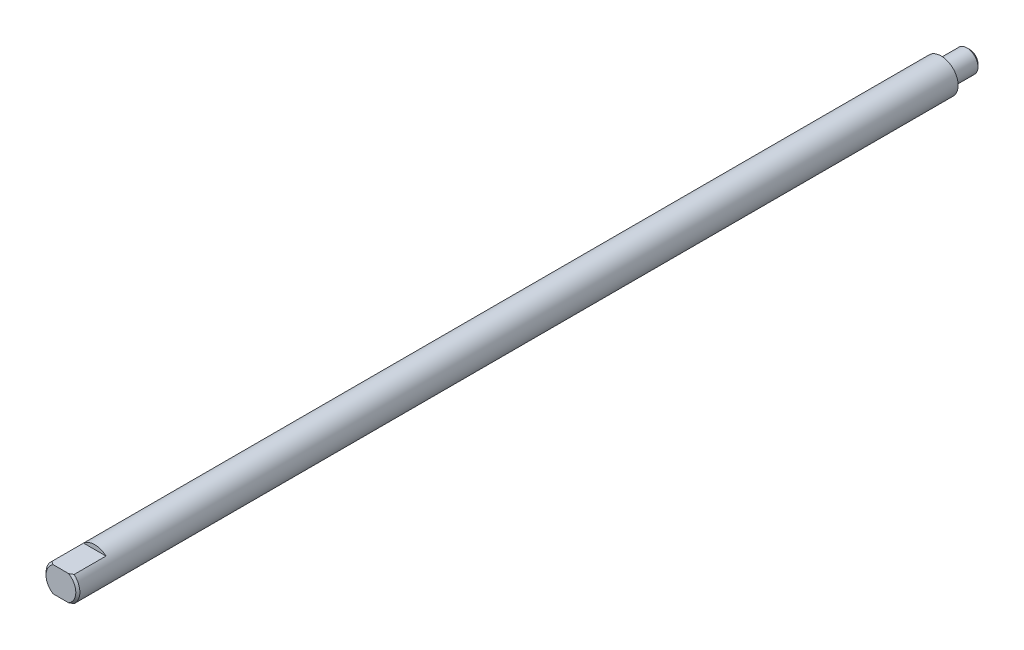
ISO-10303-21;
HEADER;
FILE_DESCRIPTION(('STEP AP214'),'2;1');
FILE_NAME('part.step','',(''),(''),'','','');
FILE_SCHEMA(('AUTOMOTIVE_DESIGN { 1 0 10303 214 1 1 1 1 }'));
ENDSEC;
DATA;
#1=APPLICATION_CONTEXT('core data for automotive mechanical design processes');
#2=APPLICATION_PROTOCOL_DEFINITION('international standard','automotive_design',2000,#1);
#3=PRODUCT_CONTEXT('',#1,'mechanical');
#4=PRODUCT('Part','Part','',(#3));
#5=PRODUCT_RELATED_PRODUCT_CATEGORY('part','',(#4));
#6=PRODUCT_DEFINITION_FORMATION('','',#4);
#7=PRODUCT_DEFINITION_CONTEXT('part definition',#1,'design');
#8=PRODUCT_DEFINITION('design','',#6,#7);
#9=PRODUCT_DEFINITION_SHAPE('','',#8);
#10=(LENGTH_UNIT() NAMED_UNIT(*) SI_UNIT(.MILLI.,.METRE.));
#11=(NAMED_UNIT(*) PLANE_ANGLE_UNIT() SI_UNIT($,.RADIAN.));
#12=(NAMED_UNIT(*) SI_UNIT($,.STERADIAN.) SOLID_ANGLE_UNIT());
#13=UNCERTAINTY_MEASURE_WITH_UNIT(LENGTH_MEASURE(1.E-05),#10,'distance_accuracy_value','');
#14=(GEOMETRIC_REPRESENTATION_CONTEXT(3) GLOBAL_UNCERTAINTY_ASSIGNED_CONTEXT((#13)) GLOBAL_UNIT_ASSIGNED_CONTEXT((#10,
#11,#12)) REPRESENTATION_CONTEXT('',''));
#15=CARTESIAN_POINT('',(0.,0.,0.));
#16=DIRECTION('',(0.,0.,1.));
#17=DIRECTION('',(1.,0.,0.));
#18=AXIS2_PLACEMENT_3D('',#15,#16,#17);
#19=CARTESIAN_POINT('',(0.,0.,3.684));
#20=DIRECTION('',(0.,0.,-1.));
#21=DIRECTION('',(0.,1.,0.));
#22=AXIS2_PLACEMENT_3D('',#19,#20,#21);
#23=CONICAL_SURFACE('',#22,3.175,0.791934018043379);
#24=CARTESIAN_POINT('',(0.,0.,3.684));
#25=DIRECTION('',(0.,0.,1.));
#26=DIRECTION('',(0.,-1.,0.));
#27=AXIS2_PLACEMENT_3D('',#24,#25,#26);
#28=CIRCLE('',#27,3.175);
#29=CARTESIAN_POINT('',(-2.10713075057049,2.37500000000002,3.684));
#30=VERTEX_POINT('',#29);
#31=CARTESIAN_POINT('',(-2.10713075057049,-2.37500000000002,3.684));
#32=VERTEX_POINT('',#31);
#33=EDGE_CURVE('E105',#30,#32,#28,.T.);
#34=ORIENTED_EDGE('',*,*,#33,.T.);
#35=CARTESIAN_POINT('',(-6.62966945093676,-2.37500000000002,-0.13301595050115));
#36=CARTESIAN_POINT('',(-6.41872085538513,-2.37500000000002,0.0629362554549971));
#37=CARTESIAN_POINT('',(-6.20729327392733,-2.37500000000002,0.258380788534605));
#38=CARTESIAN_POINT('',(-5.78286017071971,-2.37500000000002,0.647887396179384));
#39=CARTESIAN_POINT('',(-5.56985352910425,-2.37500000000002,0.841948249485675));
#40=CARTESIAN_POINT('',(-5.13574053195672,-2.37500000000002,1.23363349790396));
#41=CARTESIAN_POINT('',(-4.9145790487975,-2.37500000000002,1.43119690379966));
#42=CARTESIAN_POINT('',(-4.46963283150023,-2.37500000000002,1.82304516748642));
#43=CARTESIAN_POINT('',(-4.24585006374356,-2.37500000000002,2.01733224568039));
#44=CARTESIAN_POINT('',(-3.90719638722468,-2.37500000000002,2.30510248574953));
#45=CARTESIAN_POINT('',(-3.79385459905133,-2.37500000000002,2.40038380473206));
#46=CARTESIAN_POINT('',(-3.56590809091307,-2.37500000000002,2.58942155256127));
#47=CARTESIAN_POINT('',(-3.45130340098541,-2.37500000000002,2.6831780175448));
#48=CARTESIAN_POINT('',(-3.22025369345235,-2.37500000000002,2.86895465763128));
#49=CARTESIAN_POINT('',(-3.10380502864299,-2.37500000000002,2.96097030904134));
#50=CARTESIAN_POINT('',(-2.86892224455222,-2.37500000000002,3.1424196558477));
#51=CARTESIAN_POINT('',(-2.75048831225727,-2.37500000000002,3.23185359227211));
#52=CARTESIAN_POINT('',(-2.51255729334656,-2.37500000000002,3.40617108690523));
#53=CARTESIAN_POINT('',(-2.39309165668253,-2.37500000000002,3.49109735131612));
#54=CARTESIAN_POINT('',(-2.15090508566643,-2.37500000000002,3.65634247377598));
#55=CARTESIAN_POINT('',(-2.0281826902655,-2.37500000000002,3.73665921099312));
#56=CARTESIAN_POINT('',(-1.77912466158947,-2.37500000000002,3.89039659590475));
#57=CARTESIAN_POINT('',(-1.65280524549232,-2.37500000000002,3.96384327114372));
#58=CARTESIAN_POINT('',(-1.3951251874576,-2.37500000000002,4.10119391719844));
#59=CARTESIAN_POINT('',(-1.26377071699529,-2.37500000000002,4.16510912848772));
#60=CARTESIAN_POINT('',(-1.05701971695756,-2.37500000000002,4.25273595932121));
#61=CARTESIAN_POINT('',(-0.983728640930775,-2.37500000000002,4.28140199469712));
#62=CARTESIAN_POINT('',(-0.83535687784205,-2.37500000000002,4.33377721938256));
#63=CARTESIAN_POINT('',(-0.760275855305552,-2.37500000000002,4.35748547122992));
#64=CARTESIAN_POINT('',(-0.608898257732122,-2.37500000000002,4.39885359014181));
#65=CARTESIAN_POINT('',(-0.53261091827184,-2.37500000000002,4.41654679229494));
#66=CARTESIAN_POINT('',(-0.378780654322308,-2.37500000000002,4.44515427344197));
#67=CARTESIAN_POINT('',(-0.301238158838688,-2.37500000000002,4.45607082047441));
#68=CARTESIAN_POINT('',(-0.144559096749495,-2.37500000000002,4.47054748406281));
#69=CARTESIAN_POINT('',(-0.0654144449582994,-2.37500000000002,4.47402190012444));
#70=CARTESIAN_POINT('',(0.0928249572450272,-2.37500000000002,4.47312081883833));
#71=CARTESIAN_POINT('',(0.17191970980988,-2.37500000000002,4.46874568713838));
#72=CARTESIAN_POINT('',(0.329626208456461,-2.37500000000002,4.45241265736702));
#73=CARTESIAN_POINT('',(0.408234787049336,-2.37500000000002,4.44042470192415));
#74=CARTESIAN_POINT('',(0.564086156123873,-2.37500000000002,4.40957980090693));
#75=CARTESIAN_POINT('',(0.641328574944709,-2.37500000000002,4.39072101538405));
#76=CARTESIAN_POINT('',(0.827865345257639,-2.37500000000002,4.33746225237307));
#77=CARTESIAN_POINT('',(0.936246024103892,-2.37500000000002,4.2998770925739));
#78=CARTESIAN_POINT('',(1.14927492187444,-2.37500000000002,4.21535984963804));
#79=CARTESIAN_POINT('',(1.25392057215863,-2.37500000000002,4.16842147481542));
#80=CARTESIAN_POINT('',(1.4608710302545,-2.37500000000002,4.06709514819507));
#81=CARTESIAN_POINT('',(1.56313950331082,-2.37500000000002,4.01263383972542));
#82=CARTESIAN_POINT('',(1.71427099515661,-2.37500000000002,3.9270384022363));
#83=CARTESIAN_POINT('',(1.76426245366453,-2.37500000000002,3.89786057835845));
#84=CARTESIAN_POINT('',(1.86356372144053,-2.37500000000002,3.83837009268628));
#85=CARTESIAN_POINT('',(1.91287355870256,-2.37500000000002,3.80805747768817));
#86=CARTESIAN_POINT('',(2.07522042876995,-2.37500000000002,3.70601224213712));
#87=CARTESIAN_POINT('',(2.18692206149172,-2.37500000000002,3.63215349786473));
#88=CARTESIAN_POINT('',(2.40772318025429,-2.37500000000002,3.48062951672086));
#89=CARTESIAN_POINT('',(2.51682205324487,-2.37500000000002,3.40296339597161));
#90=CARTESIAN_POINT('',(2.73301390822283,-2.37500000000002,3.24473477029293));
#91=CARTESIAN_POINT('',(2.84010537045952,-2.37500000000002,3.16417019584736));
#92=CARTESIAN_POINT('',(3.05261723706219,-2.37500000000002,3.00086187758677));
#93=CARTESIAN_POINT('',(3.15803753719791,-2.37500000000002,2.9181179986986));
#94=CARTESIAN_POINT('',(3.47300086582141,-2.37500000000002,2.66679989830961));
#95=CARTESIAN_POINT('',(3.68051445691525,-2.37500000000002,2.49568568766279));
#96=CARTESIAN_POINT('',(4.09182405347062,-2.37500000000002,2.14926116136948));
#97=CARTESIAN_POINT('',(4.2956216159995,-2.37500000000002,1.97395267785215));
#98=CARTESIAN_POINT('',(4.67931232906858,-2.37500000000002,1.63905531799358));
#99=CARTESIAN_POINT('',(4.85946034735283,-2.37500000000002,1.47975783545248));
#100=CARTESIAN_POINT('',(5.21824582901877,-2.37500000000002,1.15942835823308));
#101=CARTESIAN_POINT('',(5.39688309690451,-2.37500000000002,0.998396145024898));
#102=CARTESIAN_POINT('',(5.75173692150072,-2.37500000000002,0.676174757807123));
#103=CARTESIAN_POINT('',(5.92796166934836,-2.37500000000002,0.514994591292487));
#104=CARTESIAN_POINT('',(6.27946145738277,-2.37500000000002,0.191659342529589));
#105=CARTESIAN_POINT('',(6.45473664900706,-2.37500000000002,0.0295044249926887));
#106=CARTESIAN_POINT('',(6.62966945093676,-2.37500000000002,-0.133015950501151));
#107=B_SPLINE_CURVE_WITH_KNOTS('',3,(#35,#36,#37,#38,#39,#40,#41,#42,#43,#44,#45,#46,#47,#48,
#49,#50,#51,#52,#53,#54,#55,#56,#57,#58,#59,#60,#61,#62,#63,#64,#65,#66,#67,#68,#69,#70,#71,#72,
#73,#74,#75,#76,#77,#78,#79,#80,#81,#82,#83,#84,#85,#86,#87,#88,#89,#90,#91,#92,#93,#94,#95,#96,
#97,#98,#99,#100,#101,#102,#103,#104,#105,#106),.UNSPECIFIED.,.F.,.F.,(4,2,2,2,2,2,2,2,2,2,2,2,
2,2,2,2,2,2,2,2,2,2,2,2,2,2,2,2,2,2,2,2,2,2,2,4),(0.,0.863760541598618,1.72820709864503,
2.61784876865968,3.50686109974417,3.95106286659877,4.39525409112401,4.84047397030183,
5.28565214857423,5.72530383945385,6.16515621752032,6.60326828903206,7.040859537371,
7.27681206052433,7.51280915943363,7.74747620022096,7.98206465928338,8.219340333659,
8.45660495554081,8.69481223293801,8.93308334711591,9.27660606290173,9.62036064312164,
9.96774119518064,10.1413805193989,10.3150126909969,10.7166254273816,11.118331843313,
11.5203310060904,11.9223551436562,12.7291420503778,13.535582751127,14.2569976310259,
14.9785044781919,15.6949553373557,16.4112883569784),.UNSPECIFIED.);
#108=CARTESIAN_POINT('',(-1.46406113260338,-2.37500000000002,4.064));
#109=VERTEX_POINT('',#108);
#110=EDGE_CURVE('E128',#32,#109,#107,.T.);
#111=ORIENTED_EDGE('',*,*,#110,.T.);
#112=CARTESIAN_POINT('',(0.,0.,4.064));
#113=DIRECTION('',(0.,0.,1.));
#114=DIRECTION('',(0.,-1.,0.));
#115=AXIS2_PLACEMENT_3D('',#112,#113,#114);
#116=CIRCLE('',#115,2.79);
#117=CARTESIAN_POINT('',(-1.46406113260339,2.37500000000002,4.064));
#118=VERTEX_POINT('',#117);
#119=EDGE_CURVE('E115',#118,#109,#116,.T.);
#120=ORIENTED_EDGE('',*,*,#119,.F.);
#121=CARTESIAN_POINT('',(6.62966945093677,2.37500000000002,-0.133015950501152));
#122=CARTESIAN_POINT('',(6.41872085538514,2.37500000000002,0.0629362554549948));
#123=CARTESIAN_POINT('',(6.20729327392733,2.37500000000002,0.258380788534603));
#124=CARTESIAN_POINT('',(5.78286017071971,2.37500000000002,0.647887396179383));
#125=CARTESIAN_POINT('',(5.56985352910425,2.37500000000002,0.841948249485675));
#126=CARTESIAN_POINT('',(5.13574053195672,2.37500000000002,1.23363349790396));
#127=CARTESIAN_POINT('',(4.9145790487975,2.37500000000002,1.43119690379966));
#128=CARTESIAN_POINT('',(4.46963283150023,2.37500000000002,1.82304516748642));
#129=CARTESIAN_POINT('',(4.24585006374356,2.37500000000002,2.01733224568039));
#130=CARTESIAN_POINT('',(3.90719638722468,2.37500000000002,2.30510248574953));
#131=CARTESIAN_POINT('',(3.79385459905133,2.37500000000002,2.40038380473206));
#132=CARTESIAN_POINT('',(3.56590809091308,2.37500000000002,2.58942155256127));
#133=CARTESIAN_POINT('',(3.45130340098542,2.37500000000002,2.6831780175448));
#134=CARTESIAN_POINT('',(3.22025369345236,2.37500000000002,2.86895465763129));
#135=CARTESIAN_POINT('',(3.10380502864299,2.37500000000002,2.96097030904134));
#136=CARTESIAN_POINT('',(2.86892224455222,2.37500000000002,3.14241965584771));
#137=CARTESIAN_POINT('',(2.75048831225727,2.37500000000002,3.23185359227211));
#138=CARTESIAN_POINT('',(2.51255729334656,2.37500000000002,3.40617108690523));
#139=CARTESIAN_POINT('',(2.39309165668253,2.37500000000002,3.49109735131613));
#140=CARTESIAN_POINT('',(2.15090508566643,2.37500000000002,3.65634247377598));
#141=CARTESIAN_POINT('',(2.0281826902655,2.37500000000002,3.73665921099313));
#142=CARTESIAN_POINT('',(1.77912466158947,2.37500000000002,3.89039659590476));
#143=CARTESIAN_POINT('',(1.65280524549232,2.37500000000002,3.96384327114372));
#144=CARTESIAN_POINT('',(1.39512518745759,2.37500000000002,4.10119391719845));
#145=CARTESIAN_POINT('',(1.26377071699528,2.37500000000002,4.16510912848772));
#146=CARTESIAN_POINT('',(1.05701971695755,2.37500000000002,4.25273595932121));
#147=CARTESIAN_POINT('',(0.983728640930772,2.37500000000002,4.28140199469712));
#148=CARTESIAN_POINT('',(0.835356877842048,2.37500000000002,4.33377721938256));
#149=CARTESIAN_POINT('',(0.76027585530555,2.37500000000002,4.35748547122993));
#150=CARTESIAN_POINT('',(0.608898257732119,2.37500000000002,4.39885359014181));
#151=CARTESIAN_POINT('',(0.532610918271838,2.37500000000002,4.41654679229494));
#152=CARTESIAN_POINT('',(0.378780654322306,2.37500000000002,4.44515427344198));
#153=CARTESIAN_POINT('',(0.301238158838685,2.37500000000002,4.45607082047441));
#154=CARTESIAN_POINT('',(0.144559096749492,2.37500000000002,4.47054748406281));
#155=CARTESIAN_POINT('',(0.0654144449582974,2.37500000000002,4.47402190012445));
#156=CARTESIAN_POINT('',(-0.0928249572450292,2.37500000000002,4.47312081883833));
#157=CARTESIAN_POINT('',(-0.171919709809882,2.37500000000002,4.46874568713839));
#158=CARTESIAN_POINT('',(-0.329626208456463,2.37500000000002,4.45241265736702));
#159=CARTESIAN_POINT('',(-0.408234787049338,2.37500000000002,4.44042470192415));
#160=CARTESIAN_POINT('',(-0.564086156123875,2.37500000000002,4.40957980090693));
#161=CARTESIAN_POINT('',(-0.641328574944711,2.37500000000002,4.39072101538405));
#162=CARTESIAN_POINT('',(-0.827865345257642,2.37500000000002,4.33746225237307));
#163=CARTESIAN_POINT('',(-0.936246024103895,2.37500000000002,4.29987709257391));
#164=CARTESIAN_POINT('',(-1.14927492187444,2.37500000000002,4.21535984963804));
#165=CARTESIAN_POINT('',(-1.25392057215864,2.37500000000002,4.16842147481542));
#166=CARTESIAN_POINT('',(-1.46087103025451,2.37500000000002,4.06709514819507));
#167=CARTESIAN_POINT('',(-1.56313950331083,2.37500000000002,4.01263383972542));
#168=CARTESIAN_POINT('',(-1.71427099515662,2.37500000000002,3.9270384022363));
#169=CARTESIAN_POINT('',(-1.76426245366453,2.37500000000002,3.89786057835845));
#170=CARTESIAN_POINT('',(-1.86356372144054,2.37500000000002,3.83837009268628));
#171=CARTESIAN_POINT('',(-1.91287355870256,2.37500000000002,3.80805747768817));
#172=CARTESIAN_POINT('',(-2.07522042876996,2.37500000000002,3.70601224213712));
#173=CARTESIAN_POINT('',(-2.18692206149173,2.37500000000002,3.63215349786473));
#174=CARTESIAN_POINT('',(-2.40772318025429,2.37500000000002,3.48062951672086));
#175=CARTESIAN_POINT('',(-2.51682205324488,2.37500000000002,3.40296339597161));
#176=CARTESIAN_POINT('',(-2.73301390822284,2.37500000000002,3.24473477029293));
#177=CARTESIAN_POINT('',(-2.84010537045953,2.37500000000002,3.16417019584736));
#178=CARTESIAN_POINT('',(-3.0526172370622,2.37500000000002,3.00086187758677));
#179=CARTESIAN_POINT('',(-3.15803753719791,2.37500000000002,2.9181179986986));
#180=CARTESIAN_POINT('',(-3.47300086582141,2.37500000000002,2.6667998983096));
#181=CARTESIAN_POINT('',(-3.68051445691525,2.37500000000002,2.49568568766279));
#182=CARTESIAN_POINT('',(-4.09182405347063,2.37500000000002,2.14926116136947));
#183=CARTESIAN_POINT('',(-4.2956216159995,2.37500000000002,1.97395267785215));
#184=CARTESIAN_POINT('',(-4.67931232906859,2.37500000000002,1.63905531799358));
#185=CARTESIAN_POINT('',(-4.85946034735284,2.37500000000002,1.47975783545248));
#186=CARTESIAN_POINT('',(-5.21824582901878,2.37500000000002,1.15942835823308));
#187=CARTESIAN_POINT('',(-5.39688309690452,2.37500000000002,0.998396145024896));
#188=CARTESIAN_POINT('',(-5.75173692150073,2.37500000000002,0.676174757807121));
#189=CARTESIAN_POINT('',(-5.92796166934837,2.37500000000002,0.514994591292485));
#190=CARTESIAN_POINT('',(-6.27946145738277,2.37500000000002,0.191659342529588));
#191=CARTESIAN_POINT('',(-6.45473664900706,2.37500000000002,0.029504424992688));
#192=CARTESIAN_POINT('',(-6.62966945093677,2.37500000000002,-0.133015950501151));
#193=B_SPLINE_CURVE_WITH_KNOTS('',3,(#121,#122,#123,#124,#125,#126,#127,#128,#129,#130,#131,
#132,#133,#134,#135,#136,#137,#138,#139,#140,#141,#142,#143,#144,#145,#146,#147,#148,#149,#150,
#151,#152,#153,#154,#155,#156,#157,#158,#159,#160,#161,#162,#163,#164,#165,#166,#167,#168,#169,
#170,#171,#172,#173,#174,#175,#176,#177,#178,#179,#180,#181,#182,#183,#184,#185,#186,#187,#188,
#189,#190,#191,#192),.UNSPECIFIED.,.F.,.F.,(4,2,2,2,2,2,2,2,2,2,2,2,2,2,2,2,2,2,2,2,2,2,2,2,2,2,
2,2,2,2,2,2,2,2,2,4),(0.,0.863760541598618,1.72820709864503,2.61784876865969,3.50686109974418,
3.95106286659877,4.39525409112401,4.84047397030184,5.28565214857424,5.72530383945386,
6.16515621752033,6.60326828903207,7.04085953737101,7.27681206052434,7.51280915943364,
7.74747620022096,7.98206465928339,8.21934033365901,8.45660495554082,8.69481223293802,
8.93308334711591,9.27660606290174,9.62036064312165,9.96774119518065,10.1413805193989,
10.3150126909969,10.7166254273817,11.1183318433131,11.5203310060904,11.9223551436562,
12.7291420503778,13.535582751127,14.2569976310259,14.9785044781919,15.6949553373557,
16.4112883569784),.UNSPECIFIED.);
#194=EDGE_CURVE('E129',#118,#30,#193,.T.);
#195=ORIENTED_EDGE('',*,*,#194,.T.);
#196=EDGE_LOOP('',(#34,#111,#120,#195));
#197=FACE_BOUND('',#196,.T.);
#198=ADVANCED_FACE('F33',(#197),#23,.T.);
#199=CARTESIAN_POINT('',(0.,0.,4.064));
#200=DIRECTION('',(0.,0.,-1.));
#201=DIRECTION('',(0.,1.,0.));
#202=AXIS2_PLACEMENT_3D('',#199,#200,#201);
#203=PLANE('',#202);
#204=ORIENTED_EDGE('',*,*,#119,.T.);
#205=DIRECTION('',(1.,0.,0.));
#206=VECTOR('',#205,1.);
#207=CARTESIAN_POINT('',(-5.,-2.37500000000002,4.064));
#208=LINE('',#207,#206);
#209=CARTESIAN_POINT('',(1.46406113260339,-2.37500000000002,4.064));
#210=VERTEX_POINT('',#209);
#211=EDGE_CURVE('E95',#109,#210,#208,.T.);
#212=ORIENTED_EDGE('',*,*,#211,.T.);
#213=CARTESIAN_POINT('',(1.46406113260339,2.37500000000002,4.064));
#214=VERTEX_POINT('',#213);
#215=EDGE_CURVE('E109',#210,#214,#116,.T.);
#216=ORIENTED_EDGE('',*,*,#215,.T.);
#217=DIRECTION('',(1.,0.,0.));
#218=VECTOR('',#217,1.);
#219=CARTESIAN_POINT('',(-5.,2.37500000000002,4.064));
#220=LINE('',#219,#218);
#221=EDGE_CURVE('E135',#118,#214,#220,.T.);
#222=ORIENTED_EDGE('',*,*,#221,.F.);
#223=EDGE_LOOP('',(#204,#212,#216,#222));
#224=FACE_BOUND('',#223,.T.);
#225=ADVANCED_FACE('F35',(#224),#203,.F.);
#226=ORIENTED_EDGE('',*,*,#215,.F.);
#227=CARTESIAN_POINT('',(2.10713075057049,-2.37500000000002,3.684));
#228=VERTEX_POINT('',#227);
#229=EDGE_CURVE('E94',#210,#228,#107,.T.);
#230=ORIENTED_EDGE('',*,*,#229,.T.);
#231=CARTESIAN_POINT('',(2.10713075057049,2.37500000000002,3.684));
#232=VERTEX_POINT('',#231);
#233=EDGE_CURVE('E101',#228,#232,#28,.T.);
#234=ORIENTED_EDGE('',*,*,#233,.T.);
#235=EDGE_CURVE('E132',#232,#214,#193,.T.);
#236=ORIENTED_EDGE('',*,*,#235,.T.);
#237=EDGE_LOOP('',(#226,#230,#234,#236));
#238=FACE_BOUND('',#237,.T.);
#239=ADVANCED_FACE('F144',(#238),#23,.T.);
#240=CARTESIAN_POINT('',(0.,0.,4.064));
#241=DIRECTION('',(0.,0.,1.));
#242=DIRECTION('',(0.,-1.,0.));
#243=AXIS2_PLACEMENT_3D('',#240,#241,#242);
#244=CYLINDRICAL_SURFACE('',#243,3.17499999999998);
#245=ORIENTED_EDGE('',*,*,#233,.F.);
#246=DIRECTION('',(0.,0.,1.));
#247=VECTOR('',#246,1.);
#248=CARTESIAN_POINT('',(2.10713075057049,-2.37500000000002,4.064));
#249=LINE('',#248,#247);
#250=CARTESIAN_POINT('',(2.10713075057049,-2.37500000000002,-2.286));
#251=VERTEX_POINT('',#250);
#252=EDGE_CURVE('E11',#228,#251,#249,.F.);
#253=ORIENTED_EDGE('',*,*,#252,.T.);
#254=CARTESIAN_POINT('',(0.,0.,-2.286));
#255=DIRECTION('',(0.,0.,-1.));
#256=DIRECTION('',(-1.,0.,0.));
#257=AXIS2_PLACEMENT_3D('',#254,#255,#256);
#258=CIRCLE('',#257,3.17499999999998);
#259=CARTESIAN_POINT('',(-2.10713075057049,-2.37500000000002,-2.286));
#260=VERTEX_POINT('',#259);
#261=EDGE_CURVE('E85',#251,#260,#258,.T.);
#262=ORIENTED_EDGE('',*,*,#261,.T.);
#263=DIRECTION('',(0.,0.,1.));
#264=VECTOR('',#263,1.);
#265=CARTESIAN_POINT('',(-2.10713075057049,-2.37500000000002,4.064));
#266=LINE('',#265,#264);
#267=EDGE_CURVE('E41',#260,#32,#266,.T.);
#268=ORIENTED_EDGE('',*,*,#267,.T.);
#269=ORIENTED_EDGE('',*,*,#33,.F.);
#270=DIRECTION('',(0.,0.,1.));
#271=VECTOR('',#270,1.);
#272=CARTESIAN_POINT('',(-2.10713075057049,2.37500000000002,4.064));
#273=LINE('',#272,#271);
#274=CARTESIAN_POINT('',(-2.10713075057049,2.37500000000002,-2.286));
#275=VERTEX_POINT('',#274);
#276=EDGE_CURVE('E118',#30,#275,#273,.F.);
#277=ORIENTED_EDGE('',*,*,#276,.T.);
#278=CARTESIAN_POINT('',(0.,0.,-2.286));
#279=DIRECTION('',(0.,0.,-1.));
#280=DIRECTION('',(-1.,0.,0.));
#281=AXIS2_PLACEMENT_3D('',#278,#279,#280);
#282=CIRCLE('',#281,3.17499999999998);
#283=CARTESIAN_POINT('',(2.10713075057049,2.37500000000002,-2.286));
#284=VERTEX_POINT('',#283);
#285=EDGE_CURVE('E121',#275,#284,#282,.T.);
#286=ORIENTED_EDGE('',*,*,#285,.T.);
#287=DIRECTION('',(0.,0.,1.));
#288=VECTOR('',#287,1.);
#289=CARTESIAN_POINT('',(2.10713075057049,2.37500000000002,4.064));
#290=LINE('',#289,#288);
#291=EDGE_CURVE('E89',#284,#232,#290,.T.);
#292=ORIENTED_EDGE('',*,*,#291,.T.);
#293=EDGE_LOOP('',(#245,#253,#262,#268,#269,#277,#286,#292));
#294=FACE_BOUND('',#293,.T.);
#295=CARTESIAN_POINT('',(0.,0.,-161.036));
#296=DIRECTION('',(0.,0.,1.));
#297=DIRECTION('',(0.,-1.,0.));
#298=AXIS2_PLACEMENT_3D('',#295,#296,#297);
#299=CIRCLE('',#298,3.17499999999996);
#300=CARTESIAN_POINT('',(0.,-3.17499999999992,-161.036));
#301=VERTEX_POINT('',#300);
#302=EDGE_CURVE('E106',#301,#301,#299,.T.);
#303=ORIENTED_EDGE('',*,*,#302,.T.);
#304=EDGE_LOOP('',(#303));
#305=FACE_BOUND('',#304,.T.);
#306=ADVANCED_FACE('F98',(#294,#305),#244,.T.);
#307=CARTESIAN_POINT('',(0.,2.08280000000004,-161.036));
#308=DIRECTION('',(0.,0.,1.));
#309=DIRECTION('',(0.,-1.,0.));
#310=AXIS2_PLACEMENT_3D('',#307,#308,#309);
#311=PLANE('',#310);
#312=ORIENTED_EDGE('',*,*,#302,.F.);
#313=EDGE_LOOP('',(#312));
#314=FACE_BOUND('',#313,.T.);
#315=CARTESIAN_POINT('',(0.,0.,-161.036));
#316=DIRECTION('',(0.,0.,1.));
#317=DIRECTION('',(0.,-1.,0.));
#318=AXIS2_PLACEMENT_3D('',#315,#316,#317);
#319=CIRCLE('',#318,2.0828);
#320=CARTESIAN_POINT('',(0.,-2.08279999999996,-161.036));
#321=VERTEX_POINT('',#320);
#322=EDGE_CURVE('E111',#321,#321,#319,.T.);
#323=ORIENTED_EDGE('',*,*,#322,.T.);
#324=EDGE_LOOP('',(#323));
#325=FACE_BOUND('',#324,.T.);
#326=ADVANCED_FACE('F165',(#314,#325),#311,.F.);
#327=CARTESIAN_POINT('',(0.,0.,4.064));
#328=DIRECTION('',(0.,0.,1.));
#329=DIRECTION('',(0.,-1.,0.));
#330=AXIS2_PLACEMENT_3D('',#327,#328,#329);
#331=CYLINDRICAL_SURFACE('',#330,2.0828);
#332=ORIENTED_EDGE('',*,*,#322,.F.);
#333=EDGE_LOOP('',(#332));
#334=FACE_BOUND('',#333,.T.);
#335=CARTESIAN_POINT('',(0.,0.,-165.86));
#336=DIRECTION('',(0.,0.,1.));
#337=DIRECTION('',(0.,-1.,0.));
#338=AXIS2_PLACEMENT_3D('',#335,#336,#337);
#339=CIRCLE('',#338,2.0828);
#340=CARTESIAN_POINT('',(0.,-2.08279999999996,-165.86));
#341=VERTEX_POINT('',#340);
#342=EDGE_CURVE('E263',#341,#341,#339,.T.);
#343=ORIENTED_EDGE('',*,*,#342,.T.);
#344=EDGE_LOOP('',(#343));
#345=FACE_BOUND('',#344,.T.);
#346=ADVANCED_FACE('F161',(#334,#345),#331,.T.);
#347=CARTESIAN_POINT('',(0.,0.,-166.37));
#348=DIRECTION('',(0.,0.,1.));
#349=DIRECTION('',(0.,-1.,0.));
#350=AXIS2_PLACEMENT_3D('',#347,#348,#349);
#351=CONICAL_SURFACE('',#350,1.57,0.788135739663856);
#352=ORIENTED_EDGE('',*,*,#342,.F.);
#353=EDGE_LOOP('',(#352));
#354=FACE_BOUND('',#353,.T.);
#355=CARTESIAN_POINT('',(0.,0.,-166.37));
#356=DIRECTION('',(0.,0.,1.));
#357=DIRECTION('',(0.,-1.,0.));
#358=AXIS2_PLACEMENT_3D('',#355,#356,#357);
#359=CIRCLE('',#358,1.57);
#360=CARTESIAN_POINT('',(0.,-1.56999999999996,-166.37));
#361=VERTEX_POINT('',#360);
#362=EDGE_CURVE('E134',#361,#361,#359,.T.);
#363=ORIENTED_EDGE('',*,*,#362,.T.);
#364=EDGE_LOOP('',(#363));
#365=FACE_BOUND('',#364,.T.);
#366=ADVANCED_FACE('F157',(#354,#365),#351,.T.);
#367=CARTESIAN_POINT('',(0.,0.,-166.37));
#368=DIRECTION('',(0.,0.,1.));
#369=DIRECTION('',(0.,-1.,0.));
#370=AXIS2_PLACEMENT_3D('',#367,#368,#369);
#371=PLANE('',#370);
#372=ORIENTED_EDGE('',*,*,#362,.F.);
#373=EDGE_LOOP('',(#372));
#374=FACE_BOUND('',#373,.T.);
#375=ADVANCED_FACE('F154',(#374),#371,.F.);
#376=CARTESIAN_POINT('',(-5.,2.37500000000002,-2.286));
#377=DIRECTION('',(0.,0.,-1.));
#378=DIRECTION('',(-1.,0.,0.));
#379=AXIS2_PLACEMENT_3D('',#376,#377,#378);
#380=PLANE('',#379);
#381=DIRECTION('',(1.,0.,0.));
#382=VECTOR('',#381,1.);
#383=CARTESIAN_POINT('',(-5.,2.37500000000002,-2.286));
#384=LINE('',#383,#382);
#385=EDGE_CURVE('E55',#275,#284,#384,.T.);
#386=ORIENTED_EDGE('',*,*,#385,.T.);
#387=ORIENTED_EDGE('',*,*,#285,.F.);
#388=EDGE_LOOP('',(#386,#387));
#389=FACE_BOUND('',#388,.T.);
#390=ADVANCED_FACE('F152',(#389),#380,.F.);
#391=CARTESIAN_POINT('',(-5.,2.37500000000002,4.064));
#392=DIRECTION('',(0.,-1.,0.));
#393=DIRECTION('',(0.,0.,-1.));
#394=AXIS2_PLACEMENT_3D('',#391,#392,#393);
#395=PLANE('',#394);
#396=ORIENTED_EDGE('',*,*,#291,.F.);
#397=ORIENTED_EDGE('',*,*,#385,.F.);
#398=ORIENTED_EDGE('',*,*,#276,.F.);
#399=ORIENTED_EDGE('',*,*,#194,.F.);
#400=ORIENTED_EDGE('',*,*,#221,.T.);
#401=ORIENTED_EDGE('',*,*,#235,.F.);
#402=EDGE_LOOP('',(#396,#397,#398,#399,#400,#401));
#403=FACE_BOUND('',#402,.T.);
#404=ADVANCED_FACE('F147',(#403),#395,.F.);
#405=CARTESIAN_POINT('',(-5.,-2.37500000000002,4.064));
#406=DIRECTION('',(0.,1.,0.));
#407=DIRECTION('',(0.,0.,1.));
#408=AXIS2_PLACEMENT_3D('',#405,#406,#407);
#409=PLANE('',#408);
#410=ORIENTED_EDGE('',*,*,#267,.F.);
#411=DIRECTION('',(1.,0.,0.));
#412=VECTOR('',#411,1.);
#413=CARTESIAN_POINT('',(-5.,-2.37500000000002,-2.286));
#414=LINE('',#413,#412);
#415=EDGE_CURVE('E47',#260,#251,#414,.T.);
#416=ORIENTED_EDGE('',*,*,#415,.T.);
#417=ORIENTED_EDGE('',*,*,#252,.F.);
#418=ORIENTED_EDGE('',*,*,#229,.F.);
#419=ORIENTED_EDGE('',*,*,#211,.F.);
#420=ORIENTED_EDGE('',*,*,#110,.F.);
#421=EDGE_LOOP('',(#410,#416,#417,#418,#419,#420));
#422=FACE_BOUND('',#421,.T.);
#423=ADVANCED_FACE('F92',(#422),#409,.F.);
#424=CARTESIAN_POINT('',(-5.,-2.37500000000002,-2.286));
#425=DIRECTION('',(0.,0.,-1.));
#426=DIRECTION('',(-1.,0.,0.));
#427=AXIS2_PLACEMENT_3D('',#424,#425,#426);
#428=PLANE('',#427);
#429=ORIENTED_EDGE('',*,*,#415,.F.);
#430=ORIENTED_EDGE('',*,*,#261,.F.);
#431=EDGE_LOOP('',(#429,#430));
#432=FACE_BOUND('',#431,.T.);
#433=ADVANCED_FACE('F86',(#432),#428,.F.);
#434=CLOSED_SHELL('',(#198,#225,#239,#306,#326,#346,#366,#375,#390,#404,#423,#433));
#435=MANIFOLD_SOLID_BREP('B2',#434);
#436=ADVANCED_BREP_SHAPE_REPRESENTATION('',(#18,#435),#14);
#437=SHAPE_DEFINITION_REPRESENTATION(#9,#436);
ENDSEC;
END-ISO-10303-21;
